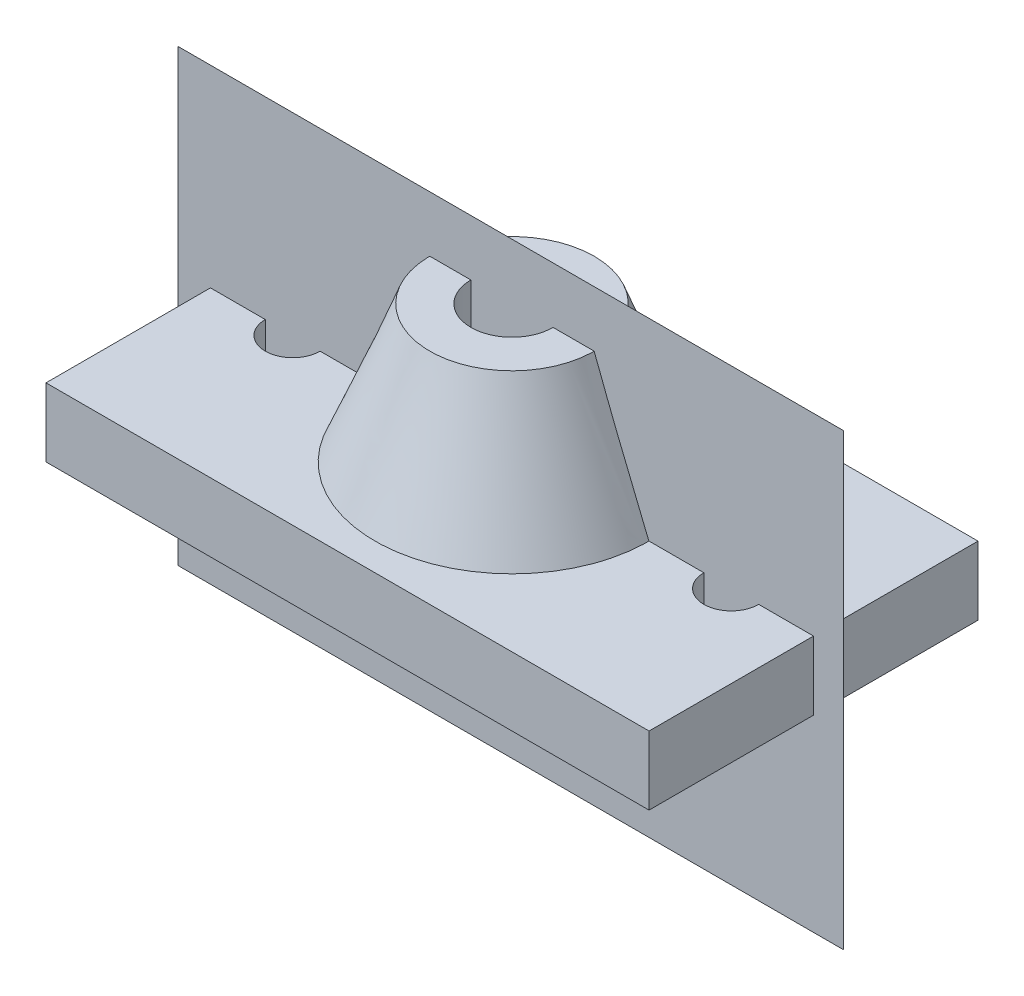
ISO-10303-21;
HEADER;
FILE_DESCRIPTION(('STEP AP214'),'2;1');
FILE_NAME('part.step','',(''),(''),'','','');
FILE_SCHEMA(('AUTOMOTIVE_DESIGN { 1 0 10303 214 1 1 1 1 }'));
ENDSEC;
DATA;
#1=APPLICATION_CONTEXT('core data for automotive mechanical design processes');
#2=APPLICATION_PROTOCOL_DEFINITION('international standard','automotive_design',2000,#1);
#3=PRODUCT_CONTEXT('',#1,'mechanical');
#4=PRODUCT('Part','Part','',(#3));
#5=PRODUCT_RELATED_PRODUCT_CATEGORY('part','',(#4));
#6=PRODUCT_DEFINITION_FORMATION('','',#4);
#7=PRODUCT_DEFINITION_CONTEXT('part definition',#1,'design');
#8=PRODUCT_DEFINITION('design','',#6,#7);
#9=PRODUCT_DEFINITION_SHAPE('','',#8);
#10=(LENGTH_UNIT() NAMED_UNIT(*) SI_UNIT(.MILLI.,.METRE.));
#11=(NAMED_UNIT(*) PLANE_ANGLE_UNIT() SI_UNIT($,.RADIAN.));
#12=(NAMED_UNIT(*) SI_UNIT($,.STERADIAN.) SOLID_ANGLE_UNIT());
#13=UNCERTAINTY_MEASURE_WITH_UNIT(LENGTH_MEASURE(1.E-05),#10,'distance_accuracy_value','');
#14=(GEOMETRIC_REPRESENTATION_CONTEXT(3) GLOBAL_UNCERTAINTY_ASSIGNED_CONTEXT((#13)) GLOBAL_UNIT_ASSIGNED_CONTEXT((#10,
#11,#12)) REPRESENTATION_CONTEXT('',''));
#15=CARTESIAN_POINT('',(0.,0.,0.));
#16=DIRECTION('',(0.,0.,1.));
#17=DIRECTION('',(1.,0.,0.));
#18=AXIS2_PLACEMENT_3D('',#15,#16,#17);
#19=CARTESIAN_POINT('',(-77.4019167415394,60.5611796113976,0.));
#20=DIRECTION('',(0.,0.,-1.));
#21=DIRECTION('',(-1.,0.,0.));
#22=AXIS2_PLACEMENT_3D('',#19,#20,#21);
#23=PLANE('',#22);
#24=DIRECTION('',(0.,-1.,0.));
#25=VECTOR('',#24,1.);
#26=CARTESIAN_POINT('',(-77.4019167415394,-43.5864731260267,0.));
#27=LINE('',#26,#25);
#28=CARTESIAN_POINT('',(-77.4019167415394,60.5611796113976,0.));
#29=VERTEX_POINT('',#28);
#30=CARTESIAN_POINT('',(-77.4019167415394,-43.5864731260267,0.));
#31=VERTEX_POINT('',#30);
#32=EDGE_CURVE('E55',#29,#31,#27,.T.);
#33=ORIENTED_EDGE('',*,*,#32,.T.);
#34=DIRECTION('',(1.,0.,0.));
#35=VECTOR('',#34,1.);
#36=CARTESIAN_POINT('',(-77.4019167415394,-43.5864731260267,0.));
#37=LINE('',#36,#35);
#38=CARTESIAN_POINT('',(76.7743336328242,-43.5864731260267,0.));
#39=VERTEX_POINT('',#38);
#40=EDGE_CURVE('E66',#31,#39,#37,.T.);
#41=ORIENTED_EDGE('',*,*,#40,.T.);
#42=DIRECTION('',(0.,1.,0.));
#43=VECTOR('',#42,1.);
#44=CARTESIAN_POINT('',(76.7743336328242,-43.5864731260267,0.));
#45=LINE('',#44,#43);
#46=CARTESIAN_POINT('',(76.7743336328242,60.5611796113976,0.));
#47=VERTEX_POINT('',#46);
#48=EDGE_CURVE('E51',#39,#47,#45,.T.);
#49=ORIENTED_EDGE('',*,*,#48,.T.);
#50=DIRECTION('',(-1.,0.,0.));
#51=VECTOR('',#50,1.);
#52=CARTESIAN_POINT('',(-77.4019167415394,60.5611796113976,0.));
#53=LINE('',#52,#51);
#54=EDGE_CURVE('E12',#47,#29,#53,.T.);
#55=ORIENTED_EDGE('',*,*,#54,.T.);
#56=EDGE_LOOP('',(#33,#41,#49,#55));
#57=FACE_BOUND('',#56,.T.);
#58=ADVANCED_FACE('F46',(#57),#23,.F.);
#59=OPEN_SHELL('',(#58));
#60=SHELL_BASED_SURFACE_MODEL('B2',(#59));
#61=CARTESIAN_POINT('',(0.,0.,0.));
#62=DIRECTION('',(0.,1.,0.));
#63=DIRECTION('',(0.,0.,1.));
#64=AXIS2_PLACEMENT_3D('',#61,#62,#63);
#65=CYLINDRICAL_SURFACE('',#64,9.525);
#66=CARTESIAN_POINT('',(0.,47.625,0.));
#67=DIRECTION('',(0.,1.,0.));
#68=DIRECTION('',(0.,0.,1.));
#69=AXIS2_PLACEMENT_3D('',#66,#67,#68);
#70=CIRCLE('',#69,9.525);
#71=CARTESIAN_POINT('',(0.,47.625,9.525));
#72=VERTEX_POINT('',#71);
#73=EDGE_CURVE('E273',#72,#72,#70,.T.);
#74=ORIENTED_EDGE('',*,*,#73,.T.);
#75=EDGE_LOOP('',(#74));
#76=FACE_BOUND('',#75,.T.);
#77=CARTESIAN_POINT('',(0.,3.175,0.));
#78=DIRECTION('',(0.,-1.,0.));
#79=DIRECTION('',(0.,0.,-1.));
#80=AXIS2_PLACEMENT_3D('',#77,#78,#79);
#81=CIRCLE('',#80,9.525);
#82=CARTESIAN_POINT('',(0.,3.175,-9.525));
#83=VERTEX_POINT('',#82);
#84=EDGE_CURVE('E95',#83,#83,#81,.F.);
#85=ORIENTED_EDGE('',*,*,#84,.F.);
#86=EDGE_LOOP('',(#85));
#87=FACE_BOUND('',#86,.T.);
#88=ADVANCED_FACE('F91',(#76,#87),#65,.F.);
#89=CARTESIAN_POINT('',(-69.85,15.875,-38.1));
#90=DIRECTION('',(0.,-1.,0.));
#91=DIRECTION('',(0.,0.,-1.));
#92=AXIS2_PLACEMENT_3D('',#89,#90,#91);
#93=PLANE('',#92);
#94=CARTESIAN_POINT('',(-50.8,15.875,0.));
#95=DIRECTION('',(0.,1.,0.));
#96=DIRECTION('',(0.,0.,-1.));
#97=AXIS2_PLACEMENT_3D('',#94,#95,#96);
#98=CIRCLE('',#97,6.35);
#99=CARTESIAN_POINT('',(-50.8,15.875,-6.35));
#100=VERTEX_POINT('',#99);
#101=EDGE_CURVE('E267',#100,#100,#98,.T.);
#102=ORIENTED_EDGE('',*,*,#101,.F.);
#103=EDGE_LOOP('',(#102));
#104=FACE_BOUND('',#103,.T.);
#105=CARTESIAN_POINT('',(50.8,15.875,0.));
#106=DIRECTION('',(0.,1.,0.));
#107=DIRECTION('',(0.,0.,1.));
#108=AXIS2_PLACEMENT_3D('',#105,#106,#107);
#109=CIRCLE('',#108,6.35);
#110=CARTESIAN_POINT('',(50.8,15.875,6.35));
#111=VERTEX_POINT('',#110);
#112=EDGE_CURVE('E266',#111,#111,#109,.T.);
#113=ORIENTED_EDGE('',*,*,#112,.F.);
#114=EDGE_LOOP('',(#113));
#115=FACE_BOUND('',#114,.T.);
#116=DIRECTION('',(0.,0.,1.));
#117=VECTOR('',#116,1.);
#118=CARTESIAN_POINT('',(-69.85,15.875,38.1));
#119=LINE('',#118,#117);
#120=CARTESIAN_POINT('',(-69.85,15.875,-38.1));
#121=VERTEX_POINT('',#120);
#122=CARTESIAN_POINT('',(-69.85,15.875,38.1));
#123=VERTEX_POINT('',#122);
#124=EDGE_CURVE('E282',#121,#123,#119,.T.);
#125=ORIENTED_EDGE('',*,*,#124,.T.);
#126=DIRECTION('',(1.,0.,0.));
#127=VECTOR('',#126,1.);
#128=CARTESIAN_POINT('',(-69.85,15.875,38.1));
#129=LINE('',#128,#127);
#130=CARTESIAN_POINT('',(69.85,15.875,38.1));
#131=VERTEX_POINT('',#130);
#132=EDGE_CURVE('E146',#123,#131,#129,.T.);
#133=ORIENTED_EDGE('',*,*,#132,.T.);
#134=DIRECTION('',(0.,0.,-1.));
#135=VECTOR('',#134,1.);
#136=CARTESIAN_POINT('',(69.85,15.875,38.1));
#137=LINE('',#136,#135);
#138=CARTESIAN_POINT('',(69.85,15.875,-38.1));
#139=VERTEX_POINT('',#138);
#140=EDGE_CURVE('E285',#131,#139,#137,.T.);
#141=ORIENTED_EDGE('',*,*,#140,.T.);
#142=DIRECTION('',(-1.,0.,0.));
#143=VECTOR('',#142,1.);
#144=CARTESIAN_POINT('',(-69.85,15.875,-38.1));
#145=LINE('',#144,#143);
#146=EDGE_CURVE('E117',#139,#121,#145,.T.);
#147=ORIENTED_EDGE('',*,*,#146,.T.);
#148=EDGE_LOOP('',(#125,#133,#141,#147));
#149=FACE_BOUND('',#148,.T.);
#150=CARTESIAN_POINT('',(0.,15.875,0.));
#151=DIRECTION('',(0.,1.,0.));
#152=DIRECTION('',(0.,0.,1.));
#153=AXIS2_PLACEMENT_3D('',#150,#151,#152);
#154=CIRCLE('',#153,31.75);
#155=CARTESIAN_POINT('',(31.7281863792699,15.875,1.17672812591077));
#156=VERTEX_POINT('',#155);
#157=EDGE_CURVE('E44',#156,#156,#154,.T.);
#158=ORIENTED_EDGE('',*,*,#157,.F.);
#159=EDGE_LOOP('',(#158));
#160=FACE_BOUND('',#159,.T.);
#161=ADVANCED_FACE('F314',(#104,#115,#149,#160),#93,.F.);
#162=CARTESIAN_POINT('',(-69.85,15.875,38.1));
#163=DIRECTION('',(1.,0.,0.));
#164=DIRECTION('',(0.,0.,-1.));
#165=AXIS2_PLACEMENT_3D('',#162,#163,#164);
#166=PLANE('',#165);
#167=DIRECTION('',(0.,0.,1.));
#168=VECTOR('',#167,1.);
#169=CARTESIAN_POINT('',(-69.85,0.,38.1));
#170=LINE('',#169,#168);
#171=CARTESIAN_POINT('',(-69.85,0.,-38.1));
#172=VERTEX_POINT('',#171);
#173=CARTESIAN_POINT('',(-69.85,0.,38.1));
#174=VERTEX_POINT('',#173);
#175=EDGE_CURVE('E280',#172,#174,#170,.T.);
#176=ORIENTED_EDGE('',*,*,#175,.T.);
#177=DIRECTION('',(0.,-1.,0.));
#178=VECTOR('',#177,1.);
#179=CARTESIAN_POINT('',(-69.85,15.875,38.1));
#180=LINE('',#179,#178);
#181=EDGE_CURVE('E100',#123,#174,#180,.T.);
#182=ORIENTED_EDGE('',*,*,#181,.F.);
#183=ORIENTED_EDGE('',*,*,#124,.F.);
#184=DIRECTION('',(0.,-1.,0.));
#185=VECTOR('',#184,1.);
#186=CARTESIAN_POINT('',(-69.85,15.875,-38.1));
#187=LINE('',#186,#185);
#188=EDGE_CURVE('E288',#121,#172,#187,.T.);
#189=ORIENTED_EDGE('',*,*,#188,.T.);
#190=EDGE_LOOP('',(#176,#182,#183,#189));
#191=FACE_BOUND('',#190,.T.);
#192=ADVANCED_FACE('F93',(#191),#166,.F.);
#193=CARTESIAN_POINT('',(-69.85,15.875,38.1));
#194=DIRECTION('',(0.,0.,-1.));
#195=DIRECTION('',(-1.,0.,0.));
#196=AXIS2_PLACEMENT_3D('',#193,#194,#195);
#197=PLANE('',#196);
#198=DIRECTION('',(1.,0.,0.));
#199=VECTOR('',#198,1.);
#200=CARTESIAN_POINT('',(-69.85,0.,38.1));
#201=LINE('',#200,#199);
#202=CARTESIAN_POINT('',(69.85,0.,38.1));
#203=VERTEX_POINT('',#202);
#204=EDGE_CURVE('E291',#174,#203,#201,.T.);
#205=ORIENTED_EDGE('',*,*,#204,.T.);
#206=DIRECTION('',(0.,-1.,0.));
#207=VECTOR('',#206,1.);
#208=CARTESIAN_POINT('',(69.85,15.875,38.1));
#209=LINE('',#208,#207);
#210=EDGE_CURVE('E299',#131,#203,#209,.T.);
#211=ORIENTED_EDGE('',*,*,#210,.F.);
#212=ORIENTED_EDGE('',*,*,#132,.F.);
#213=ORIENTED_EDGE('',*,*,#181,.T.);
#214=EDGE_LOOP('',(#205,#211,#212,#213));
#215=FACE_BOUND('',#214,.T.);
#216=ADVANCED_FACE('F302',(#215),#197,.F.);
#217=CARTESIAN_POINT('',(69.85,15.875,38.1));
#218=DIRECTION('',(-1.,0.,0.));
#219=DIRECTION('',(0.,0.,1.));
#220=AXIS2_PLACEMENT_3D('',#217,#218,#219);
#221=PLANE('',#220);
#222=DIRECTION('',(0.,0.,-1.));
#223=VECTOR('',#222,1.);
#224=CARTESIAN_POINT('',(69.85,0.,38.1));
#225=LINE('',#224,#223);
#226=CARTESIAN_POINT('',(69.85,0.,-38.1));
#227=VERTEX_POINT('',#226);
#228=EDGE_CURVE('E293',#203,#227,#225,.T.);
#229=ORIENTED_EDGE('',*,*,#228,.T.);
#230=DIRECTION('',(0.,-1.,0.));
#231=VECTOR('',#230,1.);
#232=CARTESIAN_POINT('',(69.85,15.875,-38.1));
#233=LINE('',#232,#231);
#234=EDGE_CURVE('E297',#139,#227,#233,.T.);
#235=ORIENTED_EDGE('',*,*,#234,.F.);
#236=ORIENTED_EDGE('',*,*,#140,.F.);
#237=ORIENTED_EDGE('',*,*,#210,.T.);
#238=EDGE_LOOP('',(#229,#235,#236,#237));
#239=FACE_BOUND('',#238,.T.);
#240=ADVANCED_FACE('F311',(#239),#221,.F.);
#241=CARTESIAN_POINT('',(-69.85,15.875,-38.1));
#242=DIRECTION('',(0.,0.,1.));
#243=DIRECTION('',(1.,0.,0.));
#244=AXIS2_PLACEMENT_3D('',#241,#242,#243);
#245=PLANE('',#244);
#246=DIRECTION('',(-1.,0.,0.));
#247=VECTOR('',#246,1.);
#248=CARTESIAN_POINT('',(-69.85,0.,-38.1));
#249=LINE('',#248,#247);
#250=EDGE_CURVE('E138',#227,#172,#249,.T.);
#251=ORIENTED_EDGE('',*,*,#250,.T.);
#252=ORIENTED_EDGE('',*,*,#188,.F.);
#253=ORIENTED_EDGE('',*,*,#146,.F.);
#254=ORIENTED_EDGE('',*,*,#234,.T.);
#255=EDGE_LOOP('',(#251,#252,#253,#254));
#256=FACE_BOUND('',#255,.T.);
#257=ADVANCED_FACE('F313',(#256),#245,.F.);
#258=CARTESIAN_POINT('',(-69.85,0.,-38.1));
#259=DIRECTION('',(0.,-1.,0.));
#260=DIRECTION('',(0.,0.,-1.));
#261=AXIS2_PLACEMENT_3D('',#258,#259,#260);
#262=PLANE('',#261);
#263=CARTESIAN_POINT('',(-31.75,0.,19.05));
#264=DIRECTION('',(0.,-1.,0.));
#265=DIRECTION('',(0.,0.,-1.));
#266=AXIS2_PLACEMENT_3D('',#263,#264,#265);
#267=CIRCLE('',#266,6.35);
#268=CARTESIAN_POINT('',(-31.75,0.,25.4));
#269=VERTEX_POINT('',#268);
#270=CARTESIAN_POINT('',(-38.1,0.,19.0499999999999));
#271=VERTEX_POINT('',#270);
#272=EDGE_CURVE('E108',#269,#271,#267,.T.);
#273=ORIENTED_EDGE('',*,*,#272,.F.);
#274=DIRECTION('',(-1.,0.,0.));
#275=VECTOR('',#274,1.);
#276=CARTESIAN_POINT('',(-31.75,0.,25.4));
#277=LINE('',#276,#275);
#278=CARTESIAN_POINT('',(31.75,0.,25.4));
#279=VERTEX_POINT('',#278);
#280=EDGE_CURVE('E214',#279,#269,#277,.T.);
#281=ORIENTED_EDGE('',*,*,#280,.F.);
#282=CARTESIAN_POINT('',(31.75,0.,19.05));
#283=DIRECTION('',(0.,-1.,0.));
#284=DIRECTION('',(0.,0.,-1.));
#285=AXIS2_PLACEMENT_3D('',#282,#283,#284);
#286=CIRCLE('',#285,6.35);
#287=CARTESIAN_POINT('',(38.1,0.,19.0499999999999));
#288=VERTEX_POINT('',#287);
#289=EDGE_CURVE('E217',#288,#279,#286,.T.);
#290=ORIENTED_EDGE('',*,*,#289,.F.);
#291=DIRECTION('',(0.,0.,1.));
#292=VECTOR('',#291,1.);
#293=CARTESIAN_POINT('',(38.1,0.,-19.05));
#294=LINE('',#293,#292);
#295=CARTESIAN_POINT('',(38.1,0.,-19.05));
#296=VERTEX_POINT('',#295);
#297=EDGE_CURVE('E245',#296,#288,#294,.T.);
#298=ORIENTED_EDGE('',*,*,#297,.F.);
#299=CARTESIAN_POINT('',(31.75,0.,-19.05));
#300=DIRECTION('',(0.,-1.,0.));
#301=DIRECTION('',(0.,0.,1.));
#302=AXIS2_PLACEMENT_3D('',#299,#300,#301);
#303=CIRCLE('',#302,6.35);
#304=CARTESIAN_POINT('',(31.75,0.,-25.4));
#305=VERTEX_POINT('',#304);
#306=EDGE_CURVE('E242',#305,#296,#303,.T.);
#307=ORIENTED_EDGE('',*,*,#306,.F.);
#308=DIRECTION('',(1.,0.,0.));
#309=VECTOR('',#308,1.);
#310=CARTESIAN_POINT('',(-31.75,0.,-25.4));
#311=LINE('',#310,#309);
#312=CARTESIAN_POINT('',(-31.75,0.,-25.4));
#313=VERTEX_POINT('',#312);
#314=EDGE_CURVE('E239',#313,#305,#311,.T.);
#315=ORIENTED_EDGE('',*,*,#314,.F.);
#316=CARTESIAN_POINT('',(-31.75,0.,-19.05));
#317=DIRECTION('',(0.,-1.,0.));
#318=DIRECTION('',(0.,0.,-1.));
#319=AXIS2_PLACEMENT_3D('',#316,#317,#318);
#320=CIRCLE('',#319,6.35);
#321=CARTESIAN_POINT('',(-38.1,0.,-19.05));
#322=VERTEX_POINT('',#321);
#323=EDGE_CURVE('E236',#322,#313,#320,.T.);
#324=ORIENTED_EDGE('',*,*,#323,.F.);
#325=DIRECTION('',(0.,0.,-1.));
#326=VECTOR('',#325,1.);
#327=CARTESIAN_POINT('',(-38.1,0.,-19.05));
#328=LINE('',#327,#326);
#329=EDGE_CURVE('E234',#271,#322,#328,.T.);
#330=ORIENTED_EDGE('',*,*,#329,.F.);
#331=EDGE_LOOP('',(#273,#281,#290,#298,#307,#315,#324,#330));
#332=FACE_BOUND('',#331,.T.);
#333=CARTESIAN_POINT('',(-50.8,0.,0.));
#334=DIRECTION('',(0.,1.,0.));
#335=DIRECTION('',(0.,0.,-1.));
#336=AXIS2_PLACEMENT_3D('',#333,#334,#335);
#337=CIRCLE('',#336,6.35);
#338=CARTESIAN_POINT('',(-50.8,0.,-6.35));
#339=VERTEX_POINT('',#338);
#340=EDGE_CURVE('E263',#339,#339,#337,.T.);
#341=ORIENTED_EDGE('',*,*,#340,.T.);
#342=EDGE_LOOP('',(#341));
#343=FACE_BOUND('',#342,.T.);
#344=CARTESIAN_POINT('',(50.8,0.,0.));
#345=DIRECTION('',(0.,1.,0.));
#346=DIRECTION('',(0.,0.,1.));
#347=AXIS2_PLACEMENT_3D('',#344,#345,#346);
#348=CIRCLE('',#347,6.35);
#349=CARTESIAN_POINT('',(50.8,0.,6.35));
#350=VERTEX_POINT('',#349);
#351=EDGE_CURVE('E270',#350,#350,#348,.T.);
#352=ORIENTED_EDGE('',*,*,#351,.T.);
#353=EDGE_LOOP('',(#352));
#354=FACE_BOUND('',#353,.T.);
#355=ORIENTED_EDGE('',*,*,#175,.F.);
#356=ORIENTED_EDGE('',*,*,#250,.F.);
#357=ORIENTED_EDGE('',*,*,#228,.F.);
#358=ORIENTED_EDGE('',*,*,#204,.F.);
#359=EDGE_LOOP('',(#355,#356,#357,#358));
#360=FACE_BOUND('',#359,.T.);
#361=ADVANCED_FACE('F307',(#332,#343,#354,#360),#262,.T.);
#362=CARTESIAN_POINT('',(0.,47.625,0.));
#363=DIRECTION('',(0.,1.,0.));
#364=DIRECTION('',(0.,0.,1.));
#365=AXIS2_PLACEMENT_3D('',#362,#363,#364);
#366=PLANE('',#365);
#367=ORIENTED_EDGE('',*,*,#73,.F.);
#368=EDGE_LOOP('',(#367));
#369=FACE_BOUND('',#368,.T.);
#370=CARTESIAN_POINT('',(0.,47.625,0.));
#371=DIRECTION('',(0.,1.,0.));
#372=DIRECTION('',(0.,0.,1.));
#373=AXIS2_PLACEMENT_3D('',#370,#371,#372);
#374=CIRCLE('',#373,19.05);
#375=CARTESIAN_POINT('',(18.3200784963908,47.625,5.22276017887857));
#376=VERTEX_POINT('',#375);
#377=EDGE_CURVE('E278',#376,#376,#374,.T.);
#378=ORIENTED_EDGE('',*,*,#377,.T.);
#379=EDGE_LOOP('',(#378));
#380=FACE_BOUND('',#379,.T.);
#381=ADVANCED_FACE('F324',(#369,#380),#366,.T.);
#382=CARTESIAN_POINT('',(18.3200784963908,47.625,5.22276017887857));
#383=CARTESIAN_POINT('',(31.7281863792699,15.875,1.17672812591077));
#384=CARTESIAN_POINT('',(7.87455813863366,47.625,41.8629171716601));
#385=CARTESIAN_POINT('',(29.3747301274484,15.875,64.6331008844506));
#386=CARTESIAN_POINT('',(-28.7655988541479,47.625,31.417396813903));
#387=CARTESIAN_POINT('',(-34.0816426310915,15.875,62.2796446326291));
#388=CARTESIAN_POINT('',(-18.3200784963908,47.625,-5.22276017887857));
#389=CARTESIAN_POINT('',(-31.7281863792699,15.875,-1.17672812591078));
#390=CARTESIAN_POINT('',(-7.87455813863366,47.625,-41.8629171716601));
#391=CARTESIAN_POINT('',(-29.3747301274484,15.875,-64.6331008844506));
#392=CARTESIAN_POINT('',(28.7655988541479,47.625,-31.417396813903));
#393=CARTESIAN_POINT('',(34.0816426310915,15.875,-62.2796446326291));
#394=CARTESIAN_POINT('',(18.3200784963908,47.625,5.22276017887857));
#395=CARTESIAN_POINT('',(31.7281863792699,15.875,1.17672812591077));
#396=(BOUNDED_SURFACE() B_SPLINE_SURFACE(3,1,((#382,#383),(#384,#385),(#386,#387),(#388,#389),
(#390,#391),(#392,#393),(#394,#395)),.UNSPECIFIED.,.T.,.F.,.F.) B_SPLINE_SURFACE_WITH_KNOTS((4,
3,4),(2,2),(0.,0.5,1.),(0.,1.),
.UNSPECIFIED.) GEOMETRIC_REPRESENTATION_ITEM() RATIONAL_B_SPLINE_SURFACE(((1.,1.),
(0.333333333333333,0.333333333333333),(0.333333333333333,0.333333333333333),(1.,1.),
(0.333333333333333,0.333333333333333),(0.333333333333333,0.333333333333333),(1.,1.))) REPRESENTATION_ITEM('') SURFACE());
#397=CARTESIAN_POINT('',(18.3200784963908,47.625,5.22276017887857));
#398=CARTESIAN_POINT('',(18.4597462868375,47.2942708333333,5.18061401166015));
#399=CARTESIAN_POINT('',(18.5994140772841,46.9635416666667,5.13846784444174));
#400=CARTESIAN_POINT('',(18.8787496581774,46.3020833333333,5.05417551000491));
#401=CARTESIAN_POINT('',(19.0184174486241,45.9713541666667,5.01202934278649));
#402=CARTESIAN_POINT('',(19.2977530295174,45.3098958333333,4.92773700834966));
#403=CARTESIAN_POINT('',(19.4374208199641,44.9791666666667,4.88559084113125));
#404=CARTESIAN_POINT('',(19.7167564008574,44.3177083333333,4.80129850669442));
#405=CARTESIAN_POINT('',(19.856424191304,43.9869791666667,4.75915233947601));
#406=CARTESIAN_POINT('',(20.1357597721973,43.3255208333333,4.67486000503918));
#407=CARTESIAN_POINT('',(20.275427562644,42.9947916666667,4.63271383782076));
#408=CARTESIAN_POINT('',(20.5547631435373,42.3333333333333,4.54842150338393));
#409=CARTESIAN_POINT('',(20.694430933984,42.0026041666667,4.50627533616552));
#410=CARTESIAN_POINT('',(20.9737665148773,41.3411458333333,4.42198300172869));
#411=CARTESIAN_POINT('',(21.1134343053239,41.0104166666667,4.37983683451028));
#412=CARTESIAN_POINT('',(21.3927698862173,40.3489583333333,4.29554450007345));
#413=CARTESIAN_POINT('',(21.5324376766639,40.0182291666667,4.25339833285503));
#414=CARTESIAN_POINT('',(21.8117732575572,39.3567708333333,4.1691059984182));
#415=CARTESIAN_POINT('',(21.9514410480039,39.0260416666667,4.12695983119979));
#416=CARTESIAN_POINT('',(22.2307766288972,38.3645833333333,4.04266749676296));
#417=CARTESIAN_POINT('',(22.3704444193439,38.0338541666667,4.00052132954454));
#418=CARTESIAN_POINT('',(22.6497800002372,37.3723958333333,3.91622899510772));
#419=CARTESIAN_POINT('',(22.7894477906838,37.0416666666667,3.8740828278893));
#420=CARTESIAN_POINT('',(23.0687833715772,36.3802083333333,3.78979049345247));
#421=CARTESIAN_POINT('',(23.2084511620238,36.0494791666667,3.74764432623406));
#422=CARTESIAN_POINT('',(23.4877867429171,35.3880208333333,3.66335199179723));
#423=CARTESIAN_POINT('',(23.6274545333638,35.0572916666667,3.62120582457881));
#424=CARTESIAN_POINT('',(23.9067901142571,34.3958333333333,3.53691349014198));
#425=CARTESIAN_POINT('',(24.0464579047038,34.0651041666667,3.49476732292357));
#426=CARTESIAN_POINT('',(24.3257934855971,33.4036458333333,3.41047498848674));
#427=CARTESIAN_POINT('',(24.4654612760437,33.0729166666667,3.36832882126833));
#428=CARTESIAN_POINT('',(24.7447968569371,32.4114583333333,3.2840364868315));
#429=CARTESIAN_POINT('',(24.8844646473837,32.0807291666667,3.24189031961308));
#430=CARTESIAN_POINT('',(25.163800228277,31.4192708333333,3.15759798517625));
#431=CARTESIAN_POINT('',(25.3034680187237,31.0885416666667,3.11545181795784));
#432=CARTESIAN_POINT('',(25.582803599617,30.4270833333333,3.03115948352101));
#433=CARTESIAN_POINT('',(25.7224713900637,30.0963541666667,2.9890133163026));
#434=CARTESIAN_POINT('',(26.001806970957,29.4348958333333,2.90472098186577));
#435=CARTESIAN_POINT('',(26.1414747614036,29.1041666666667,2.86257481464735));
#436=CARTESIAN_POINT('',(26.4208103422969,28.4427083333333,2.77828248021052));
#437=CARTESIAN_POINT('',(26.5604781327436,28.1119791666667,2.73613631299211));
#438=CARTESIAN_POINT('',(26.8398137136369,27.4505208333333,2.65184397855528));
#439=CARTESIAN_POINT('',(26.9794815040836,27.1197916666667,2.60969781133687));
#440=CARTESIAN_POINT('',(27.2588170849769,26.4583333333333,2.52540547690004));
#441=CARTESIAN_POINT('',(27.3984848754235,26.1276041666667,2.48325930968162));
#442=CARTESIAN_POINT('',(27.6778204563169,25.4661458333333,2.39896697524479));
#443=CARTESIAN_POINT('',(27.8174882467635,25.1354166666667,2.35682080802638));
#444=CARTESIAN_POINT('',(28.0968238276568,24.4739583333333,2.27252847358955));
#445=CARTESIAN_POINT('',(28.2364916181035,24.1432291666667,2.23038230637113));
#446=CARTESIAN_POINT('',(28.5158271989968,23.4817708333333,2.14608997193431));
#447=CARTESIAN_POINT('',(28.6554949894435,23.1510416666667,2.10394380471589));
#448=CARTESIAN_POINT('',(28.9348305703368,22.4895833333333,2.01965147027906));
#449=CARTESIAN_POINT('',(29.0744983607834,22.1588541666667,1.97750530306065));
#450=CARTESIAN_POINT('',(29.3538339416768,21.4973958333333,1.89321296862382));
#451=CARTESIAN_POINT('',(29.4935017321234,21.1666666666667,1.8510668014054));
#452=CARTESIAN_POINT('',(29.7728373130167,20.5052083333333,1.76677446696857));
#453=CARTESIAN_POINT('',(29.9125051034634,20.1744791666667,1.72462829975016));
#454=CARTESIAN_POINT('',(30.1918406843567,19.5130208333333,1.64033596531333));
#455=CARTESIAN_POINT('',(30.3315084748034,19.1822916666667,1.59818979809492));
#456=CARTESIAN_POINT('',(30.6108440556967,18.5208333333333,1.51389746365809));
#457=CARTESIAN_POINT('',(30.7505118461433,18.1901041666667,1.47175129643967));
#458=CARTESIAN_POINT('',(31.0298474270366,17.5286458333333,1.38745896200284));
#459=CARTESIAN_POINT('',(31.1695152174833,17.1979166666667,1.34531279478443));
#460=CARTESIAN_POINT('',(31.4488507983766,16.5364583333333,1.2610204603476));
#461=CARTESIAN_POINT('',(31.5885185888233,16.2057291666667,1.21887429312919));
#462=CARTESIAN_POINT('',(31.7281863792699,15.875,1.17672812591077));
#463=B_SPLINE_CURVE_WITH_KNOTS('',3,(#397,#398,#399,#400,#401,#402,#403,#404,#405,#406,#407,
#408,#409,#410,#411,#412,#413,#414,#415,#416,#417,#418,#419,#420,#421,#422,#423,#424,#425,#426,
#427,#428,#429,#430,#431,#432,#433,#434,#435,#436,#437,#438,#439,#440,#441,#442,#443,#444,#445,
#446,#447,#448,#449,#450,#451,#452,#453,#454,#455,#456,#457,#458,#459,#460,#461,#462),
.UNSPECIFIED.,.F.,.F.,(4,2,2,2,2,2,2,2,2,2,2,2,2,2,2,2,2,2,2,2,2,2,2,2,2,2,2,2,2,2,2,2,4),(0.,
1.08442913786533,2.16885827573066,3.25328741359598,4.33771655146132,5.42214568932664,
6.50657482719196,7.59100396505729,8.67543310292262,9.75986224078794,10.8442913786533,
11.9287205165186,13.0131496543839,14.0975787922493,15.1820079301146,16.2664370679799,
17.3508662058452,18.4352953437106,19.5197244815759,20.6041536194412,21.6885827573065,
22.7730118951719,23.8574410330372,24.9418701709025,26.0262993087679,27.1107284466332,
28.1951575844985,29.2795867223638,30.3640158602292,31.4484449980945,32.5328741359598,
33.6173032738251,34.7017324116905),.UNSPECIFIED.);
#464=EDGE_CURVE('BSEAM321',#376,#156,#463,.T.);
#465=ORIENTED_EDGE('',*,*,#377,.F.);
#466=ORIENTED_EDGE('',*,*,#157,.T.);
#467=ORIENTED_EDGE('',*,*,#464,.T.);
#468=ORIENTED_EDGE('',*,*,#464,.F.);
#469=EDGE_LOOP('',(#465,#467,#466,#468));
#470=FACE_BOUND('',#469,.T.);
#471=ADVANCED_FACE('F321',(#470),#396,.T.);
#472=CARTESIAN_POINT('',(50.8,0.,0.));
#473=DIRECTION('',(0.,1.,0.));
#474=DIRECTION('',(0.,0.,1.));
#475=AXIS2_PLACEMENT_3D('',#472,#473,#474);
#476=CYLINDRICAL_SURFACE('',#475,6.35);
#477=ORIENTED_EDGE('',*,*,#351,.F.);
#478=EDGE_LOOP('',(#477));
#479=FACE_BOUND('',#478,.T.);
#480=ORIENTED_EDGE('',*,*,#112,.T.);
#481=EDGE_LOOP('',(#480));
#482=FACE_BOUND('',#481,.T.);
#483=ADVANCED_FACE('F323',(#479,#482),#476,.F.);
#484=CARTESIAN_POINT('',(-50.8,0.,0.));
#485=DIRECTION('',(0.,1.,0.));
#486=DIRECTION('',(0.,0.,1.));
#487=AXIS2_PLACEMENT_3D('',#484,#485,#486);
#488=CYLINDRICAL_SURFACE('',#487,6.35);
#489=ORIENTED_EDGE('',*,*,#340,.F.);
#490=EDGE_LOOP('',(#489));
#491=FACE_BOUND('',#490,.T.);
#492=ORIENTED_EDGE('',*,*,#101,.T.);
#493=EDGE_LOOP('',(#492));
#494=FACE_BOUND('',#493,.T.);
#495=ADVANCED_FACE('F331',(#491,#494),#488,.F.);
#496=CARTESIAN_POINT('',(-31.75,3.175,19.05));
#497=DIRECTION('',(0.,-1.,0.));
#498=DIRECTION('',(0.,0.,-1.));
#499=AXIS2_PLACEMENT_3D('',#496,#497,#498);
#500=PLANE('',#499);
#501=CARTESIAN_POINT('',(-31.75,3.175,19.05));
#502=DIRECTION('',(0.,-1.,0.));
#503=DIRECTION('',(0.,0.,-1.));
#504=AXIS2_PLACEMENT_3D('',#501,#502,#503);
#505=CIRCLE('',#504,6.35);
#506=CARTESIAN_POINT('',(-31.75,3.175,25.4));
#507=VERTEX_POINT('',#506);
#508=CARTESIAN_POINT('',(-38.1,3.175,19.0499999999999));
#509=VERTEX_POINT('',#508);
#510=EDGE_CURVE('E194',#507,#509,#505,.T.);
#511=ORIENTED_EDGE('',*,*,#510,.T.);
#512=DIRECTION('',(0.,0.,-1.));
#513=VECTOR('',#512,1.);
#514=CARTESIAN_POINT('',(-38.1,3.175,-19.05));
#515=LINE('',#514,#513);
#516=CARTESIAN_POINT('',(-38.1,3.175,-19.05));
#517=VERTEX_POINT('',#516);
#518=EDGE_CURVE('E203',#509,#517,#515,.T.);
#519=ORIENTED_EDGE('',*,*,#518,.T.);
#520=CARTESIAN_POINT('',(-31.75,3.175,-19.05));
#521=DIRECTION('',(0.,-1.,0.));
#522=DIRECTION('',(0.,0.,-1.));
#523=AXIS2_PLACEMENT_3D('',#520,#521,#522);
#524=CIRCLE('',#523,6.35);
#525=CARTESIAN_POINT('',(-31.75,3.175,-25.4));
#526=VERTEX_POINT('',#525);
#527=EDGE_CURVE('E208',#517,#526,#524,.T.);
#528=ORIENTED_EDGE('',*,*,#527,.T.);
#529=DIRECTION('',(1.,0.,0.));
#530=VECTOR('',#529,1.);
#531=CARTESIAN_POINT('',(-31.75,3.175,-25.4));
#532=LINE('',#531,#530);
#533=CARTESIAN_POINT('',(31.75,3.175,-25.4));
#534=VERTEX_POINT('',#533);
#535=EDGE_CURVE('E221',#526,#534,#532,.T.);
#536=ORIENTED_EDGE('',*,*,#535,.T.);
#537=CARTESIAN_POINT('',(31.75,3.175,-19.05));
#538=DIRECTION('',(0.,-1.,0.));
#539=DIRECTION('',(0.,0.,1.));
#540=AXIS2_PLACEMENT_3D('',#537,#538,#539);
#541=CIRCLE('',#540,6.35);
#542=CARTESIAN_POINT('',(38.1,3.175,-19.05));
#543=VERTEX_POINT('',#542);
#544=EDGE_CURVE('E224',#534,#543,#541,.T.);
#545=ORIENTED_EDGE('',*,*,#544,.T.);
#546=DIRECTION('',(0.,0.,1.));
#547=VECTOR('',#546,1.);
#548=CARTESIAN_POINT('',(38.1,3.175,-19.05));
#549=LINE('',#548,#547);
#550=CARTESIAN_POINT('',(38.1,3.175,19.0499999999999));
#551=VERTEX_POINT('',#550);
#552=EDGE_CURVE('E227',#543,#551,#549,.T.);
#553=ORIENTED_EDGE('',*,*,#552,.T.);
#554=CARTESIAN_POINT('',(31.75,3.175,19.05));
#555=DIRECTION('',(0.,-1.,0.));
#556=DIRECTION('',(0.,0.,-1.));
#557=AXIS2_PLACEMENT_3D('',#554,#555,#556);
#558=CIRCLE('',#557,6.35);
#559=CARTESIAN_POINT('',(31.75,3.175,25.4));
#560=VERTEX_POINT('',#559);
#561=EDGE_CURVE('E230',#551,#560,#558,.T.);
#562=ORIENTED_EDGE('',*,*,#561,.T.);
#563=DIRECTION('',(-1.,0.,0.));
#564=VECTOR('',#563,1.);
#565=CARTESIAN_POINT('',(-31.75,3.175,25.4));
#566=LINE('',#565,#564);
#567=EDGE_CURVE('E200',#560,#507,#566,.T.);
#568=ORIENTED_EDGE('',*,*,#567,.T.);
#569=EDGE_LOOP('',(#511,#519,#528,#536,#545,#553,#562,#568));
#570=FACE_BOUND('',#569,.T.);
#571=ORIENTED_EDGE('',*,*,#84,.T.);
#572=EDGE_LOOP('',(#571));
#573=FACE_BOUND('',#572,.T.);
#574=ADVANCED_FACE('F210',(#570,#573),#500,.T.);
#575=CARTESIAN_POINT('',(-31.75,3.175,19.05));
#576=DIRECTION('',(0.,-1.,0.));
#577=DIRECTION('',(0.,0.,-1.));
#578=AXIS2_PLACEMENT_3D('',#575,#576,#577);
#579=CYLINDRICAL_SURFACE('',#578,6.35);
#580=ORIENTED_EDGE('',*,*,#272,.T.);
#581=DIRECTION('',(0.,-1.,0.));
#582=VECTOR('',#581,1.);
#583=CARTESIAN_POINT('',(-38.1,3.175,19.0499999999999));
#584=LINE('',#583,#582);
#585=EDGE_CURVE('E190',#509,#271,#584,.T.);
#586=ORIENTED_EDGE('',*,*,#585,.F.);
#587=ORIENTED_EDGE('',*,*,#510,.F.);
#588=DIRECTION('',(0.,-1.,0.));
#589=VECTOR('',#588,1.);
#590=CARTESIAN_POINT('',(-31.75,3.175,25.4));
#591=LINE('',#590,#589);
#592=EDGE_CURVE('E250',#507,#269,#591,.T.);
#593=ORIENTED_EDGE('',*,*,#592,.T.);
#594=EDGE_LOOP('',(#580,#586,#587,#593));
#595=FACE_BOUND('',#594,.T.);
#596=ADVANCED_FACE('F192',(#595),#579,.F.);
#597=CARTESIAN_POINT('',(-31.75,3.175,25.4));
#598=DIRECTION('',(0.,0.,1.));
#599=DIRECTION('',(1.,0.,0.));
#600=AXIS2_PLACEMENT_3D('',#597,#598,#599);
#601=PLANE('',#600);
#602=ORIENTED_EDGE('',*,*,#280,.T.);
#603=ORIENTED_EDGE('',*,*,#592,.F.);
#604=ORIENTED_EDGE('',*,*,#567,.F.);
#605=DIRECTION('',(0.,-1.,0.));
#606=VECTOR('',#605,1.);
#607=CARTESIAN_POINT('',(31.75,3.175,25.4));
#608=LINE('',#607,#606);
#609=EDGE_CURVE('E252',#560,#279,#608,.T.);
#610=ORIENTED_EDGE('',*,*,#609,.T.);
#611=EDGE_LOOP('',(#602,#603,#604,#610));
#612=FACE_BOUND('',#611,.T.);
#613=ADVANCED_FACE('F351',(#612),#601,.F.);
#614=CARTESIAN_POINT('',(31.75,3.175,19.05));
#615=DIRECTION('',(0.,-1.,0.));
#616=DIRECTION('',(0.,0.,-1.));
#617=AXIS2_PLACEMENT_3D('',#614,#615,#616);
#618=CYLINDRICAL_SURFACE('',#617,6.35);
#619=ORIENTED_EDGE('',*,*,#289,.T.);
#620=ORIENTED_EDGE('',*,*,#609,.F.);
#621=ORIENTED_EDGE('',*,*,#561,.F.);
#622=DIRECTION('',(0.,-1.,0.));
#623=VECTOR('',#622,1.);
#624=CARTESIAN_POINT('',(38.1,3.175,19.0499999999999));
#625=LINE('',#624,#623);
#626=EDGE_CURVE('E254',#551,#288,#625,.T.);
#627=ORIENTED_EDGE('',*,*,#626,.T.);
#628=EDGE_LOOP('',(#619,#620,#621,#627));
#629=FACE_BOUND('',#628,.T.);
#630=ADVANCED_FACE('F369',(#629),#618,.F.);
#631=CARTESIAN_POINT('',(38.1,3.175,-19.05));
#632=DIRECTION('',(1.,0.,0.));
#633=DIRECTION('',(0.,0.,-1.));
#634=AXIS2_PLACEMENT_3D('',#631,#632,#633);
#635=PLANE('',#634);
#636=ORIENTED_EDGE('',*,*,#297,.T.);
#637=ORIENTED_EDGE('',*,*,#626,.F.);
#638=ORIENTED_EDGE('',*,*,#552,.F.);
#639=DIRECTION('',(0.,-1.,0.));
#640=VECTOR('',#639,1.);
#641=CARTESIAN_POINT('',(38.1,3.175,-19.05));
#642=LINE('',#641,#640);
#643=EDGE_CURVE('E256',#543,#296,#642,.T.);
#644=ORIENTED_EDGE('',*,*,#643,.T.);
#645=EDGE_LOOP('',(#636,#637,#638,#644));
#646=FACE_BOUND('',#645,.T.);
#647=ADVANCED_FACE('F365',(#646),#635,.F.);
#648=CARTESIAN_POINT('',(31.75,3.175,-19.05));
#649=DIRECTION('',(0.,-1.,0.));
#650=DIRECTION('',(0.,0.,-1.));
#651=AXIS2_PLACEMENT_3D('',#648,#649,#650);
#652=CYLINDRICAL_SURFACE('',#651,6.35);
#653=ORIENTED_EDGE('',*,*,#306,.T.);
#654=ORIENTED_EDGE('',*,*,#643,.F.);
#655=ORIENTED_EDGE('',*,*,#544,.F.);
#656=DIRECTION('',(0.,-1.,0.));
#657=VECTOR('',#656,1.);
#658=CARTESIAN_POINT('',(31.75,3.175,-25.4));
#659=LINE('',#658,#657);
#660=EDGE_CURVE('E258',#534,#305,#659,.T.);
#661=ORIENTED_EDGE('',*,*,#660,.T.);
#662=EDGE_LOOP('',(#653,#654,#655,#661));
#663=FACE_BOUND('',#662,.T.);
#664=ADVANCED_FACE('F361',(#663),#652,.F.);
#665=CARTESIAN_POINT('',(-31.75,3.175,-25.4));
#666=DIRECTION('',(0.,0.,-1.));
#667=DIRECTION('',(-1.,0.,0.));
#668=AXIS2_PLACEMENT_3D('',#665,#666,#667);
#669=PLANE('',#668);
#670=ORIENTED_EDGE('',*,*,#314,.T.);
#671=ORIENTED_EDGE('',*,*,#660,.F.);
#672=ORIENTED_EDGE('',*,*,#535,.F.);
#673=DIRECTION('',(0.,-1.,0.));
#674=VECTOR('',#673,1.);
#675=CARTESIAN_POINT('',(-31.75,3.175,-25.4));
#676=LINE('',#675,#674);
#677=EDGE_CURVE('E260',#526,#313,#676,.T.);
#678=ORIENTED_EDGE('',*,*,#677,.T.);
#679=EDGE_LOOP('',(#670,#671,#672,#678));
#680=FACE_BOUND('',#679,.T.);
#681=ADVANCED_FACE('F357',(#680),#669,.F.);
#682=CARTESIAN_POINT('',(-31.75,3.175,-19.05));
#683=DIRECTION('',(0.,-1.,0.));
#684=DIRECTION('',(0.,0.,-1.));
#685=AXIS2_PLACEMENT_3D('',#682,#683,#684);
#686=CYLINDRICAL_SURFACE('',#685,6.35);
#687=ORIENTED_EDGE('',*,*,#323,.T.);
#688=ORIENTED_EDGE('',*,*,#677,.F.);
#689=ORIENTED_EDGE('',*,*,#527,.F.);
#690=DIRECTION('',(0.,-1.,0.));
#691=VECTOR('',#690,1.);
#692=CARTESIAN_POINT('',(-38.1,3.175,-19.05));
#693=LINE('',#692,#691);
#694=EDGE_CURVE('E199',#517,#322,#693,.T.);
#695=ORIENTED_EDGE('',*,*,#694,.T.);
#696=EDGE_LOOP('',(#687,#688,#689,#695));
#697=FACE_BOUND('',#696,.T.);
#698=ADVANCED_FACE('F354',(#697),#686,.F.);
#699=CARTESIAN_POINT('',(-38.1,3.175,-19.05));
#700=DIRECTION('',(-1.,0.,0.));
#701=DIRECTION('',(0.,0.,1.));
#702=AXIS2_PLACEMENT_3D('',#699,#700,#701);
#703=PLANE('',#702);
#704=ORIENTED_EDGE('',*,*,#329,.T.);
#705=ORIENTED_EDGE('',*,*,#694,.F.);
#706=ORIENTED_EDGE('',*,*,#518,.F.);
#707=ORIENTED_EDGE('',*,*,#585,.T.);
#708=EDGE_LOOP('',(#704,#705,#706,#707));
#709=FACE_BOUND('',#708,.T.);
#710=ADVANCED_FACE('F204',(#709),#703,.F.);
#711=CLOSED_SHELL('',(#88,#161,#192,#216,#240,#257,#361,#381,#471,#483,#495,#574,#596,#613,#630,
#647,#664,#681,#698,#710));
#712=MANIFOLD_SOLID_BREP('B6',#711);
#713=ADVANCED_BREP_SHAPE_REPRESENTATION('',(#18,#712),#14);
#714=MANIFOLD_SURFACE_SHAPE_REPRESENTATION('',(#18,#60),#14);
#715=SHAPE_REPRESENTATION('',(#18),#14);
#716=SHAPE_DEFINITION_REPRESENTATION(#9,#715);
#717=SHAPE_REPRESENTATION_RELATIONSHIP('','',#715,#713);
#718=SHAPE_REPRESENTATION_RELATIONSHIP('','',#715,#714);
ENDSEC;
END-ISO-10303-21;
